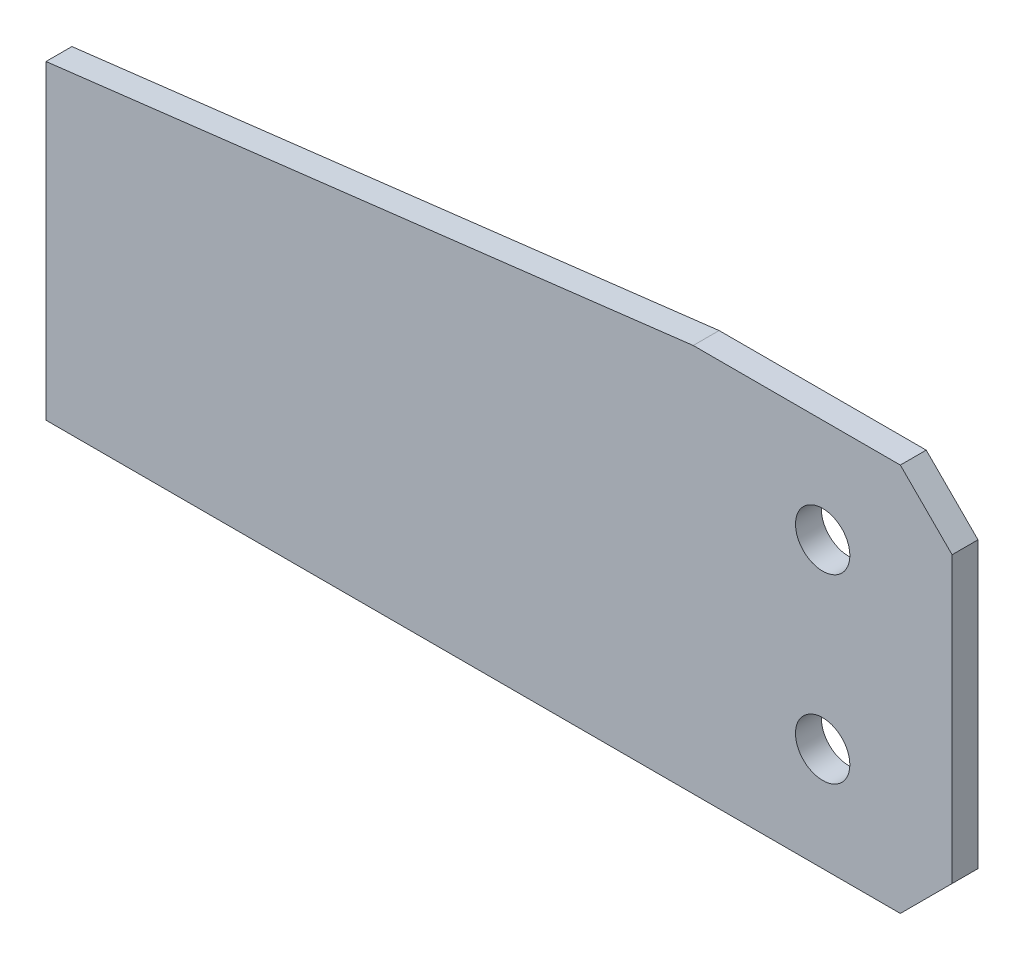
from build123d import *

# Parameters (mm, degrees)
ESQUISSE1_R          = 10.5
BASE_EXTRUSION_DEPTH = 10


with BuildPart() as part:
    # Esquisse1 → Base-Extrusion (new body)
    with BuildSketch(Plane.XY):
        Polygon((-100, 0), (-350, -30), (-350, -150), (-20, -150), (0, -130), (0, -20), (-20, 0), align=None)
        with Locations((-50, -40)):
            Circle(ESQUISSE1_R, mode=Mode.SUBTRACT)
        with Locations((-50, -110)):
            Circle(ESQUISSE1_R, mode=Mode.SUBTRACT)
    extrude(amount=BASE_EXTRUSION_DEPTH)


solid = part.part
